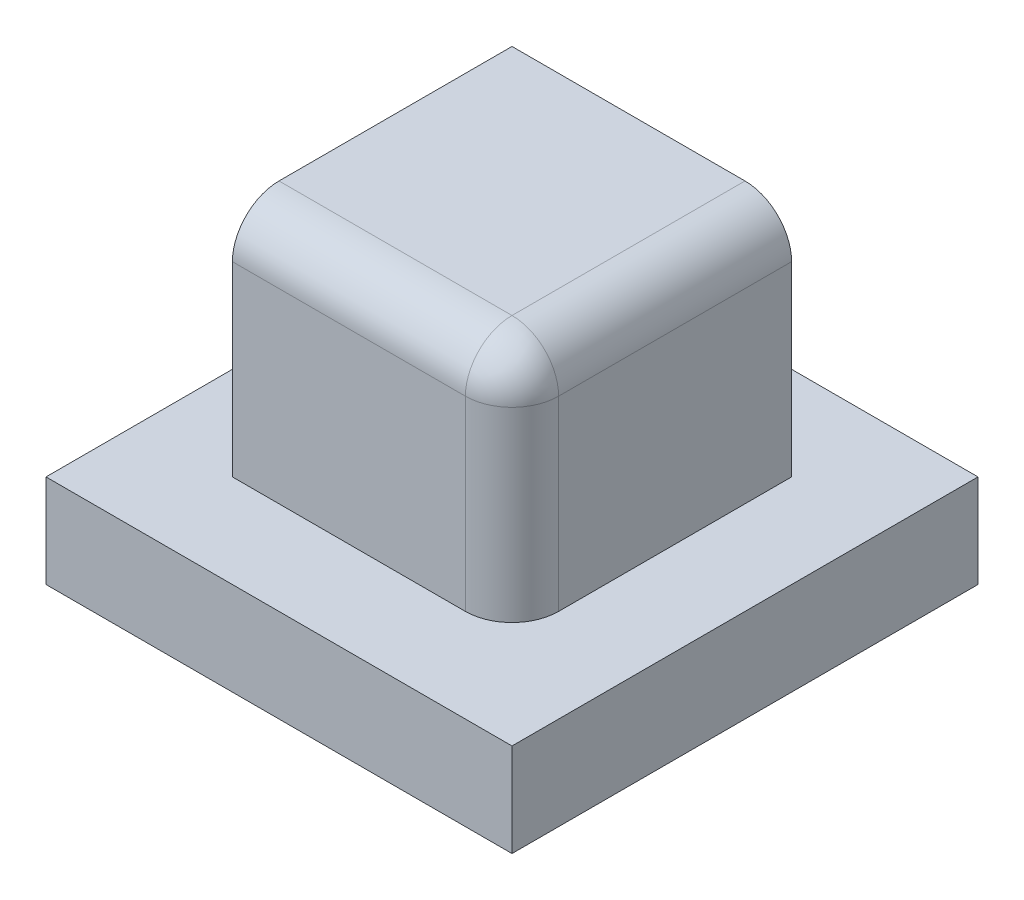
ISO-10303-21;
HEADER;
FILE_DESCRIPTION(('STEP AP214'),'2;1');
FILE_NAME('part.step','',(''),(''),'','','');
FILE_SCHEMA(('AUTOMOTIVE_DESIGN { 1 0 10303 214 1 1 1 1 }'));
ENDSEC;
DATA;
#1=APPLICATION_CONTEXT('core data for automotive mechanical design processes');
#2=APPLICATION_PROTOCOL_DEFINITION('international standard','automotive_design',2000,#1);
#3=PRODUCT_CONTEXT('',#1,'mechanical');
#4=PRODUCT('Part','Part','',(#3));
#5=PRODUCT_RELATED_PRODUCT_CATEGORY('part','',(#4));
#6=PRODUCT_DEFINITION_FORMATION('','',#4);
#7=PRODUCT_DEFINITION_CONTEXT('part definition',#1,'design');
#8=PRODUCT_DEFINITION('design','',#6,#7);
#9=PRODUCT_DEFINITION_SHAPE('','',#8);
#10=(LENGTH_UNIT() NAMED_UNIT(*) SI_UNIT(.MILLI.,.METRE.));
#11=(NAMED_UNIT(*) PLANE_ANGLE_UNIT() SI_UNIT($,.RADIAN.));
#12=(NAMED_UNIT(*) SI_UNIT($,.STERADIAN.) SOLID_ANGLE_UNIT());
#13=UNCERTAINTY_MEASURE_WITH_UNIT(LENGTH_MEASURE(1.E-05),#10,'distance_accuracy_value','');
#14=(GEOMETRIC_REPRESENTATION_CONTEXT(3) GLOBAL_UNCERTAINTY_ASSIGNED_CONTEXT((#13)) GLOBAL_UNIT_ASSIGNED_CONTEXT((#10,
#11,#12)) REPRESENTATION_CONTEXT('',''));
#15=CARTESIAN_POINT('',(0.,0.,0.));
#16=DIRECTION('',(0.,0.,1.));
#17=DIRECTION('',(1.,0.,0.));
#18=AXIS2_PLACEMENT_3D('',#15,#16,#17);
#19=CARTESIAN_POINT('',(-50.,20.,50.));
#20=DIRECTION('',(0.,-1.,0.));
#21=DIRECTION('',(1.,0.,0.));
#22=AXIS2_PLACEMENT_3D('',#19,#20,#21);
#23=PLANE('',#22);
#24=DIRECTION('',(-1.,0.,0.));
#25=VECTOR('',#24,1.);
#26=CARTESIAN_POINT('',(-50.,20.,-50.));
#27=LINE('',#26,#25);
#28=CARTESIAN_POINT('',(50.,20.,-50.));
#29=VERTEX_POINT('',#28);
#30=CARTESIAN_POINT('',(-50.,20.,-50.));
#31=VERTEX_POINT('',#30);
#32=EDGE_CURVE('E145',#29,#31,#27,.T.);
#33=ORIENTED_EDGE('',*,*,#32,.T.);
#34=DIRECTION('',(0.,0.,-1.));
#35=VECTOR('',#34,1.);
#36=CARTESIAN_POINT('',(-50.,20.,50.));
#37=LINE('',#36,#35);
#38=CARTESIAN_POINT('',(-50.,20.,50.));
#39=VERTEX_POINT('',#38);
#40=EDGE_CURVE('E156',#39,#31,#37,.T.);
#41=ORIENTED_EDGE('',*,*,#40,.F.);
#42=DIRECTION('',(-1.,0.,0.));
#43=VECTOR('',#42,1.);
#44=CARTESIAN_POINT('',(-50.,20.,50.));
#45=LINE('',#44,#43);
#46=CARTESIAN_POINT('',(50.,20.,50.));
#47=VERTEX_POINT('',#46);
#48=EDGE_CURVE('E154',#47,#39,#45,.T.);
#49=ORIENTED_EDGE('',*,*,#48,.F.);
#50=DIRECTION('',(0.,0.,-1.));
#51=VECTOR('',#50,1.);
#52=CARTESIAN_POINT('',(50.,20.,50.));
#53=LINE('',#52,#51);
#54=EDGE_CURVE('E159',#47,#29,#53,.T.);
#55=ORIENTED_EDGE('',*,*,#54,.T.);
#56=EDGE_LOOP('',(#33,#41,#49,#55));
#57=FACE_BOUND('',#56,.T.);
#58=DIRECTION('',(0.,0.,-1.));
#59=VECTOR('',#58,1.);
#60=CARTESIAN_POINT('',(30.,20.,30.));
#61=LINE('',#60,#59);
#62=CARTESIAN_POINT('',(30.,20.,20.));
#63=VERTEX_POINT('',#62);
#64=CARTESIAN_POINT('',(30.,20.,-30.));
#65=VERTEX_POINT('',#64);
#66=EDGE_CURVE('E190',#63,#65,#61,.T.);
#67=ORIENTED_EDGE('',*,*,#66,.F.);
#68=CARTESIAN_POINT('',(20.,20.,20.));
#69=DIRECTION('',(0.,-1.,0.));
#70=DIRECTION('',(1.,0.,0.));
#71=AXIS2_PLACEMENT_3D('',#68,#69,#70);
#72=CIRCLE('',#71,10.);
#73=CARTESIAN_POINT('',(20.,20.,30.));
#74=VERTEX_POINT('',#73);
#75=EDGE_CURVE('E11',#63,#74,#72,.T.);
#76=ORIENTED_EDGE('',*,*,#75,.T.);
#77=DIRECTION('',(1.,0.,0.));
#78=VECTOR('',#77,1.);
#79=CARTESIAN_POINT('',(30.,20.,30.));
#80=LINE('',#79,#78);
#81=CARTESIAN_POINT('',(-30.,20.,30.));
#82=VERTEX_POINT('',#81);
#83=EDGE_CURVE('E120',#82,#74,#80,.T.);
#84=ORIENTED_EDGE('',*,*,#83,.F.);
#85=DIRECTION('',(0.,0.,1.));
#86=VECTOR('',#85,1.);
#87=CARTESIAN_POINT('',(-30.,20.,30.));
#88=LINE('',#87,#86);
#89=CARTESIAN_POINT('',(-30.,20.,-30.));
#90=VERTEX_POINT('',#89);
#91=EDGE_CURVE('E197',#90,#82,#88,.T.);
#92=ORIENTED_EDGE('',*,*,#91,.F.);
#93=DIRECTION('',(-1.,0.,0.));
#94=VECTOR('',#93,1.);
#95=CARTESIAN_POINT('',(30.,20.,-30.));
#96=LINE('',#95,#94);
#97=EDGE_CURVE('E127',#65,#90,#96,.T.);
#98=ORIENTED_EDGE('',*,*,#97,.F.);
#99=EDGE_LOOP('',(#67,#76,#84,#92,#98));
#100=FACE_BOUND('',#99,.T.);
#101=ADVANCED_FACE('F33',(#57,#100),#23,.F.);
#102=CARTESIAN_POINT('',(-50.,20.,50.));
#103=DIRECTION('',(1.,0.,0.));
#104=DIRECTION('',(0.,1.,0.));
#105=AXIS2_PLACEMENT_3D('',#102,#103,#104);
#106=PLANE('',#105);
#107=DIRECTION('',(0.,-1.,0.));
#108=VECTOR('',#107,1.);
#109=CARTESIAN_POINT('',(-50.,20.,-50.));
#110=LINE('',#109,#108);
#111=CARTESIAN_POINT('',(-50.,0.,-50.));
#112=VERTEX_POINT('',#111);
#113=EDGE_CURVE('E138',#31,#112,#110,.T.);
#114=ORIENTED_EDGE('',*,*,#113,.T.);
#115=DIRECTION('',(0.,0.,-1.));
#116=VECTOR('',#115,1.);
#117=CARTESIAN_POINT('',(-50.,0.,50.));
#118=LINE('',#117,#116);
#119=CARTESIAN_POINT('',(-50.,0.,50.));
#120=VERTEX_POINT('',#119);
#121=EDGE_CURVE('E165',#120,#112,#118,.T.);
#122=ORIENTED_EDGE('',*,*,#121,.F.);
#123=DIRECTION('',(0.,-1.,0.));
#124=VECTOR('',#123,1.);
#125=CARTESIAN_POINT('',(-50.,20.,50.));
#126=LINE('',#125,#124);
#127=EDGE_CURVE('E147',#39,#120,#126,.T.);
#128=ORIENTED_EDGE('',*,*,#127,.F.);
#129=ORIENTED_EDGE('',*,*,#40,.T.);
#130=EDGE_LOOP('',(#114,#122,#128,#129));
#131=FACE_BOUND('',#130,.T.);
#132=ADVANCED_FACE('F221',(#131),#106,.F.);
#133=CARTESIAN_POINT('',(-50.,0.,50.));
#134=DIRECTION('',(0.,1.,0.));
#135=DIRECTION('',(0.,0.,1.));
#136=AXIS2_PLACEMENT_3D('',#133,#134,#135);
#137=PLANE('',#136);
#138=DIRECTION('',(1.,0.,0.));
#139=VECTOR('',#138,1.);
#140=CARTESIAN_POINT('',(-50.,0.,-50.));
#141=LINE('',#140,#139);
#142=CARTESIAN_POINT('',(50.,0.,-50.));
#143=VERTEX_POINT('',#142);
#144=EDGE_CURVE('E141',#112,#143,#141,.T.);
#145=ORIENTED_EDGE('',*,*,#144,.T.);
#146=DIRECTION('',(0.,0.,-1.));
#147=VECTOR('',#146,1.);
#148=CARTESIAN_POINT('',(50.,0.,50.));
#149=LINE('',#148,#147);
#150=CARTESIAN_POINT('',(50.,0.,50.));
#151=VERTEX_POINT('',#150);
#152=EDGE_CURVE('E162',#151,#143,#149,.T.);
#153=ORIENTED_EDGE('',*,*,#152,.F.);
#154=DIRECTION('',(1.,0.,0.));
#155=VECTOR('',#154,1.);
#156=CARTESIAN_POINT('',(-50.,0.,50.));
#157=LINE('',#156,#155);
#158=EDGE_CURVE('E150',#120,#151,#157,.T.);
#159=ORIENTED_EDGE('',*,*,#158,.F.);
#160=ORIENTED_EDGE('',*,*,#121,.T.);
#161=EDGE_LOOP('',(#145,#153,#159,#160));
#162=FACE_BOUND('',#161,.T.);
#163=ADVANCED_FACE('F227',(#162),#137,.F.);
#164=CARTESIAN_POINT('',(50.,20.,50.));
#165=DIRECTION('',(-1.,0.,0.));
#166=DIRECTION('',(0.,0.,1.));
#167=AXIS2_PLACEMENT_3D('',#164,#165,#166);
#168=PLANE('',#167);
#169=DIRECTION('',(0.,1.,0.));
#170=VECTOR('',#169,1.);
#171=CARTESIAN_POINT('',(50.,20.,-50.));
#172=LINE('',#171,#170);
#173=EDGE_CURVE('E143',#143,#29,#172,.T.);
#174=ORIENTED_EDGE('',*,*,#173,.T.);
#175=ORIENTED_EDGE('',*,*,#54,.F.);
#176=DIRECTION('',(0.,1.,0.));
#177=VECTOR('',#176,1.);
#178=CARTESIAN_POINT('',(50.,20.,50.));
#179=LINE('',#178,#177);
#180=EDGE_CURVE('E152',#151,#47,#179,.T.);
#181=ORIENTED_EDGE('',*,*,#180,.F.);
#182=ORIENTED_EDGE('',*,*,#152,.T.);
#183=EDGE_LOOP('',(#174,#175,#181,#182));
#184=FACE_BOUND('',#183,.T.);
#185=ADVANCED_FACE('F234',(#184),#168,.F.);
#186=CARTESIAN_POINT('',(-50.,20.,50.));
#187=DIRECTION('',(0.,0.,1.));
#188=DIRECTION('',(1.,0.,0.));
#189=AXIS2_PLACEMENT_3D('',#186,#187,#188);
#190=PLANE('',#189);
#191=ORIENTED_EDGE('',*,*,#127,.T.);
#192=ORIENTED_EDGE('',*,*,#158,.T.);
#193=ORIENTED_EDGE('',*,*,#180,.T.);
#194=ORIENTED_EDGE('',*,*,#48,.T.);
#195=EDGE_LOOP('',(#191,#192,#193,#194));
#196=FACE_BOUND('',#195,.T.);
#197=ADVANCED_FACE('F232',(#196),#190,.T.);
#198=CARTESIAN_POINT('',(-50.,20.,-50.));
#199=DIRECTION('',(0.,0.,1.));
#200=DIRECTION('',(1.,0.,0.));
#201=AXIS2_PLACEMENT_3D('',#198,#199,#200);
#202=PLANE('',#201);
#203=ORIENTED_EDGE('',*,*,#113,.F.);
#204=ORIENTED_EDGE('',*,*,#32,.F.);
#205=ORIENTED_EDGE('',*,*,#173,.F.);
#206=ORIENTED_EDGE('',*,*,#144,.F.);
#207=EDGE_LOOP('',(#203,#204,#205,#206));
#208=FACE_BOUND('',#207,.T.);
#209=ADVANCED_FACE('F250',(#208),#202,.F.);
#210=CARTESIAN_POINT('',(30.,70.,30.));
#211=DIRECTION('',(-1.,0.,0.));
#212=DIRECTION('',(0.,-1.,0.));
#213=AXIS2_PLACEMENT_3D('',#210,#211,#212);
#214=PLANE('',#213);
#215=DIRECTION('',(0.,0.,-1.));
#216=VECTOR('',#215,1.);
#217=CARTESIAN_POINT('',(30.,60.,30.));
#218=LINE('',#217,#216);
#219=CARTESIAN_POINT('',(30.,60.,-30.));
#220=VERTEX_POINT('',#219);
#221=CARTESIAN_POINT('',(30.,60.,20.));
#222=VERTEX_POINT('',#221);
#223=EDGE_CURVE('E168',#220,#222,#218,.F.);
#224=ORIENTED_EDGE('',*,*,#223,.T.);
#225=DIRECTION('',(0.,-1.,0.));
#226=VECTOR('',#225,1.);
#227=CARTESIAN_POINT('',(30.,70.,20.));
#228=LINE('',#227,#226);
#229=EDGE_CURVE('E170',#222,#63,#228,.T.);
#230=ORIENTED_EDGE('',*,*,#229,.T.);
#231=ORIENTED_EDGE('',*,*,#66,.T.);
#232=DIRECTION('',(0.,-1.,0.));
#233=VECTOR('',#232,1.);
#234=CARTESIAN_POINT('',(30.,70.,-30.));
#235=LINE('',#234,#233);
#236=EDGE_CURVE('E129',#220,#65,#235,.T.);
#237=ORIENTED_EDGE('',*,*,#236,.F.);
#238=EDGE_LOOP('',(#224,#230,#231,#237));
#239=FACE_BOUND('',#238,.T.);
#240=ADVANCED_FACE('F259',(#239),#214,.F.);
#241=CARTESIAN_POINT('',(30.,70.,-30.));
#242=DIRECTION('',(0.,0.,1.));
#243=DIRECTION('',(1.,0.,0.));
#244=AXIS2_PLACEMENT_3D('',#241,#242,#243);
#245=PLANE('',#244);
#246=DIRECTION('',(-1.,0.,0.));
#247=VECTOR('',#246,1.);
#248=CARTESIAN_POINT('',(30.,70.,-30.));
#249=LINE('',#248,#247);
#250=CARTESIAN_POINT('',(20.,70.,-30.));
#251=VERTEX_POINT('',#250);
#252=CARTESIAN_POINT('',(-30.,70.,-30.));
#253=VERTEX_POINT('',#252);
#254=EDGE_CURVE('E113',#251,#253,#249,.T.);
#255=ORIENTED_EDGE('',*,*,#254,.F.);
#256=CARTESIAN_POINT('',(20.,60.,-30.));
#257=DIRECTION('',(0.,0.,1.));
#258=DIRECTION('',(1.,0.,0.));
#259=AXIS2_PLACEMENT_3D('',#256,#257,#258);
#260=CIRCLE('',#259,10.);
#261=EDGE_CURVE('E179',#251,#220,#260,.F.);
#262=ORIENTED_EDGE('',*,*,#261,.T.);
#263=ORIENTED_EDGE('',*,*,#236,.T.);
#264=ORIENTED_EDGE('',*,*,#97,.T.);
#265=DIRECTION('',(0.,-1.,0.));
#266=VECTOR('',#265,1.);
#267=CARTESIAN_POINT('',(-30.,70.,-30.));
#268=LINE('',#267,#266);
#269=EDGE_CURVE('E124',#253,#90,#268,.T.);
#270=ORIENTED_EDGE('',*,*,#269,.F.);
#271=EDGE_LOOP('',(#255,#262,#263,#264,#270));
#272=FACE_BOUND('',#271,.T.);
#273=ADVANCED_FACE('F125',(#272),#245,.F.);
#274=CARTESIAN_POINT('',(-30.,70.,30.));
#275=DIRECTION('',(1.,0.,0.));
#276=DIRECTION('',(0.,1.,0.));
#277=AXIS2_PLACEMENT_3D('',#274,#275,#276);
#278=PLANE('',#277);
#279=DIRECTION('',(0.,-1.,0.));
#280=VECTOR('',#279,1.);
#281=CARTESIAN_POINT('',(-30.,70.,30.));
#282=LINE('',#281,#280);
#283=CARTESIAN_POINT('',(-30.,60.,30.));
#284=VERTEX_POINT('',#283);
#285=EDGE_CURVE('E130',#284,#82,#282,.T.);
#286=ORIENTED_EDGE('',*,*,#285,.F.);
#287=CARTESIAN_POINT('',(-30.,60.,20.));
#288=DIRECTION('',(1.,0.,0.));
#289=DIRECTION('',(0.,1.,0.));
#290=AXIS2_PLACEMENT_3D('',#287,#288,#289);
#291=CIRCLE('',#290,10.);
#292=CARTESIAN_POINT('',(-30.,70.,20.));
#293=VERTEX_POINT('',#292);
#294=EDGE_CURVE('E42',#284,#293,#291,.F.);
#295=ORIENTED_EDGE('',*,*,#294,.T.);
#296=DIRECTION('',(0.,0.,1.));
#297=VECTOR('',#296,1.);
#298=CARTESIAN_POINT('',(-30.,70.,30.));
#299=LINE('',#298,#297);
#300=EDGE_CURVE('E116',#253,#293,#299,.T.);
#301=ORIENTED_EDGE('',*,*,#300,.F.);
#302=ORIENTED_EDGE('',*,*,#269,.T.);
#303=ORIENTED_EDGE('',*,*,#91,.T.);
#304=EDGE_LOOP('',(#286,#295,#301,#302,#303));
#305=FACE_BOUND('',#304,.T.);
#306=ADVANCED_FACE('F132',(#305),#278,.F.);
#307=CARTESIAN_POINT('',(30.,70.,30.));
#308=DIRECTION('',(0.,0.,-1.));
#309=DIRECTION('',(-1.,0.,0.));
#310=AXIS2_PLACEMENT_3D('',#307,#308,#309);
#311=PLANE('',#310);
#312=ORIENTED_EDGE('',*,*,#83,.T.);
#313=DIRECTION('',(0.,-1.,0.));
#314=VECTOR('',#313,1.);
#315=CARTESIAN_POINT('',(20.,70.,30.));
#316=LINE('',#315,#314);
#317=CARTESIAN_POINT('',(20.,60.,30.));
#318=VERTEX_POINT('',#317);
#319=EDGE_CURVE('E175',#74,#318,#316,.F.);
#320=ORIENTED_EDGE('',*,*,#319,.T.);
#321=DIRECTION('',(1.,0.,0.));
#322=VECTOR('',#321,1.);
#323=CARTESIAN_POINT('',(-30.,60.,30.));
#324=LINE('',#323,#322);
#325=EDGE_CURVE('E173',#318,#284,#324,.F.);
#326=ORIENTED_EDGE('',*,*,#325,.T.);
#327=ORIENTED_EDGE('',*,*,#285,.T.);
#328=EDGE_LOOP('',(#312,#320,#326,#327));
#329=FACE_BOUND('',#328,.T.);
#330=ADVANCED_FACE('F204',(#329),#311,.F.);
#331=CARTESIAN_POINT('',(30.,70.,-30.));
#332=DIRECTION('',(0.,1.,0.));
#333=DIRECTION('',(-1.,0.,0.));
#334=AXIS2_PLACEMENT_3D('',#331,#332,#333);
#335=PLANE('',#334);
#336=DIRECTION('',(1.,0.,0.));
#337=VECTOR('',#336,1.);
#338=CARTESIAN_POINT('',(30.,70.,20.));
#339=LINE('',#338,#337);
#340=CARTESIAN_POINT('',(20.,70.,20.));
#341=VERTEX_POINT('',#340);
#342=EDGE_CURVE('E50',#293,#341,#339,.T.);
#343=ORIENTED_EDGE('',*,*,#342,.T.);
#344=DIRECTION('',(0.,0.,-1.));
#345=VECTOR('',#344,1.);
#346=CARTESIAN_POINT('',(20.,70.,-30.));
#347=LINE('',#346,#345);
#348=EDGE_CURVE('E117',#341,#251,#347,.T.);
#349=ORIENTED_EDGE('',*,*,#348,.T.);
#350=ORIENTED_EDGE('',*,*,#254,.T.);
#351=ORIENTED_EDGE('',*,*,#300,.T.);
#352=EDGE_LOOP('',(#343,#349,#350,#351));
#353=FACE_BOUND('',#352,.T.);
#354=ADVANCED_FACE('F115',(#353),#335,.T.);
#355=CARTESIAN_POINT('',(30.,60.,20.));
#356=DIRECTION('',(-1.,0.,0.));
#357=DIRECTION('',(0.,-1.,0.));
#358=AXIS2_PLACEMENT_3D('',#355,#356,#357);
#359=CYLINDRICAL_SURFACE('',#358,10.);
#360=ORIENTED_EDGE('',*,*,#294,.F.);
#361=ORIENTED_EDGE('',*,*,#325,.F.);
#362=CARTESIAN_POINT('',(20.,60.,20.));
#363=DIRECTION('',(1.,0.,0.));
#364=DIRECTION('',(0.,0.,-1.));
#365=AXIS2_PLACEMENT_3D('',#362,#363,#364);
#366=CIRCLE('',#365,10.);
#367=EDGE_CURVE('E37',#341,#318,#366,.T.);
#368=ORIENTED_EDGE('',*,*,#367,.F.);
#369=ORIENTED_EDGE('',*,*,#342,.F.);
#370=EDGE_LOOP('',(#360,#361,#368,#369));
#371=FACE_BOUND('',#370,.T.);
#372=ADVANCED_FACE('F35',(#371),#359,.T.);
#373=CARTESIAN_POINT('',(20.,60.,-30.));
#374=DIRECTION('',(0.,0.,1.));
#375=DIRECTION('',(1.,0.,0.));
#376=AXIS2_PLACEMENT_3D('',#373,#374,#375);
#377=CYLINDRICAL_SURFACE('',#376,10.);
#378=ORIENTED_EDGE('',*,*,#261,.F.);
#379=ORIENTED_EDGE('',*,*,#348,.F.);
#380=CARTESIAN_POINT('',(20.,60.,20.));
#381=DIRECTION('',(0.,0.,1.));
#382=DIRECTION('',(0.,-1.,0.));
#383=AXIS2_PLACEMENT_3D('',#380,#381,#382);
#384=CIRCLE('',#383,10.);
#385=EDGE_CURVE('E184',#222,#341,#384,.T.);
#386=ORIENTED_EDGE('',*,*,#385,.F.);
#387=ORIENTED_EDGE('',*,*,#223,.F.);
#388=EDGE_LOOP('',(#378,#379,#386,#387));
#389=FACE_BOUND('',#388,.T.);
#390=ADVANCED_FACE('F212',(#389),#377,.T.);
#391=CARTESIAN_POINT('',(20.,60.,20.));
#392=DIRECTION('',(0.,0.,1.));
#393=DIRECTION('',(1.,0.,0.));
#394=AXIS2_PLACEMENT_3D('',#391,#392,#393);
#395=SPHERICAL_SURFACE('',#394,10.);
#396=ORIENTED_EDGE('',*,*,#385,.T.);
#397=ORIENTED_EDGE('',*,*,#367,.T.);
#398=CARTESIAN_POINT('',(20.,60.,20.));
#399=DIRECTION('',(0.,1.,0.));
#400=DIRECTION('',(0.,0.,1.));
#401=AXIS2_PLACEMENT_3D('',#398,#399,#400);
#402=CIRCLE('',#401,10.);
#403=EDGE_CURVE('E182',#222,#318,#402,.F.);
#404=ORIENTED_EDGE('',*,*,#403,.F.);
#405=EDGE_LOOP('',(#396,#397,#404));
#406=FACE_BOUND('',#405,.T.);
#407=ADVANCED_FACE('F210',(#406),#395,.T.);
#408=CARTESIAN_POINT('',(20.,70.,20.));
#409=DIRECTION('',(0.,-1.,0.));
#410=DIRECTION('',(1.,0.,0.));
#411=AXIS2_PLACEMENT_3D('',#408,#409,#410);
#412=CYLINDRICAL_SURFACE('',#411,10.);
#413=ORIENTED_EDGE('',*,*,#403,.T.);
#414=ORIENTED_EDGE('',*,*,#319,.F.);
#415=ORIENTED_EDGE('',*,*,#75,.F.);
#416=ORIENTED_EDGE('',*,*,#229,.F.);
#417=EDGE_LOOP('',(#413,#414,#415,#416));
#418=FACE_BOUND('',#417,.T.);
#419=ADVANCED_FACE('F208',(#418),#412,.T.);
#420=CLOSED_SHELL('',(#101,#132,#163,#185,#197,#209,#240,#273,#306,#330,#354,#372,#390,#407,#419));
#421=MANIFOLD_SOLID_BREP('B2',#420);
#422=ADVANCED_BREP_SHAPE_REPRESENTATION('',(#18,#421),#14);
#423=SHAPE_DEFINITION_REPRESENTATION(#9,#422);
ENDSEC;
END-ISO-10303-21;
